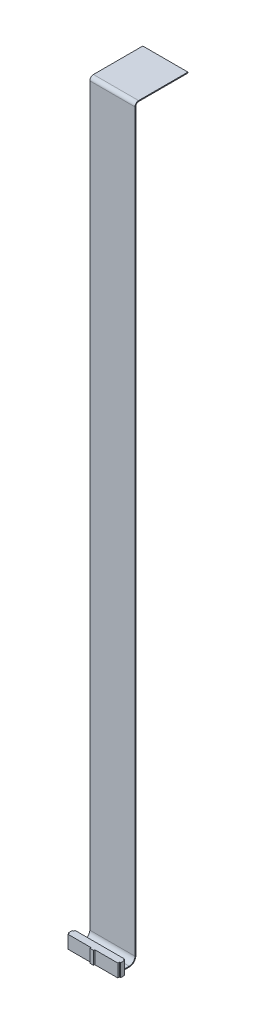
ISO-10303-21;
HEADER;
FILE_DESCRIPTION(('STEP AP214'),'2;1');
FILE_NAME('part.step','',(''),(''),'','','');
FILE_SCHEMA(('AUTOMOTIVE_DESIGN { 1 0 10303 214 1 1 1 1 }'));
ENDSEC;
DATA;
#1=APPLICATION_CONTEXT('core data for automotive mechanical design processes');
#2=APPLICATION_PROTOCOL_DEFINITION('international standard','automotive_design',2000,#1);
#3=PRODUCT_CONTEXT('',#1,'mechanical');
#4=PRODUCT('Part','Part','',(#3));
#5=PRODUCT_RELATED_PRODUCT_CATEGORY('part','',(#4));
#6=PRODUCT_DEFINITION_FORMATION('','',#4);
#7=PRODUCT_DEFINITION_CONTEXT('part definition',#1,'design');
#8=PRODUCT_DEFINITION('design','',#6,#7);
#9=PRODUCT_DEFINITION_SHAPE('','',#8);
#10=(LENGTH_UNIT() NAMED_UNIT(*) SI_UNIT(.MILLI.,.METRE.));
#11=(NAMED_UNIT(*) PLANE_ANGLE_UNIT() SI_UNIT($,.RADIAN.));
#12=(NAMED_UNIT(*) SI_UNIT($,.STERADIAN.) SOLID_ANGLE_UNIT());
#13=UNCERTAINTY_MEASURE_WITH_UNIT(LENGTH_MEASURE(1.E-05),#10,'distance_accuracy_value','');
#14=(GEOMETRIC_REPRESENTATION_CONTEXT(3) GLOBAL_UNCERTAINTY_ASSIGNED_CONTEXT((#13)) GLOBAL_UNIT_ASSIGNED_CONTEXT((#10,
#11,#12)) REPRESENTATION_CONTEXT('',''));
#15=CARTESIAN_POINT('',(0.,0.,0.));
#16=DIRECTION('',(0.,0.,1.));
#17=DIRECTION('',(1.,0.,0.));
#18=AXIS2_PLACEMENT_3D('',#15,#16,#17);
#19=CARTESIAN_POINT('',(-21.685,11.3,-6.));
#20=DIRECTION('',(1.,0.,0.));
#21=DIRECTION('',(0.,0.,-1.));
#22=AXIS2_PLACEMENT_3D('',#19,#20,#21);
#23=PLANE('',#22);
#24=DIRECTION('',(0.,0.,1.));
#25=VECTOR('',#24,1.);
#26=CARTESIAN_POINT('',(-21.685,0.,-6.));
#27=LINE('',#26,#25);
#28=CARTESIAN_POINT('',(-21.685,0.,-6.));
#29=VERTEX_POINT('',#28);
#30=CARTESIAN_POINT('',(-21.685,0.,-4.69999999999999));
#31=VERTEX_POINT('',#30);
#32=EDGE_CURVE('E329',#29,#31,#27,.T.);
#33=ORIENTED_EDGE('',*,*,#32,.T.);
#34=DIRECTION('',(0.,-1.,0.));
#35=VECTOR('',#34,1.);
#36=CARTESIAN_POINT('',(-21.685,11.3,-4.69999999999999));
#37=LINE('',#36,#35);
#38=CARTESIAN_POINT('',(-21.685,11.3,-4.69999999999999));
#39=VERTEX_POINT('',#38);
#40=EDGE_CURVE('E11',#39,#31,#37,.T.);
#41=ORIENTED_EDGE('',*,*,#40,.F.);
#42=DIRECTION('',(0.,0.,1.));
#43=VECTOR('',#42,1.);
#44=CARTESIAN_POINT('',(-21.685,11.3,-6.));
#45=LINE('',#44,#43);
#46=CARTESIAN_POINT('',(-21.685,11.3,-6.));
#47=VERTEX_POINT('',#46);
#48=EDGE_CURVE('E330',#47,#39,#45,.T.);
#49=ORIENTED_EDGE('',*,*,#48,.F.);
#50=DIRECTION('',(0.,-1.,0.));
#51=VECTOR('',#50,1.);
#52=CARTESIAN_POINT('',(-21.685,11.3,-6.));
#53=LINE('',#52,#51);
#54=EDGE_CURVE('E364',#47,#29,#53,.T.);
#55=ORIENTED_EDGE('',*,*,#54,.T.);
#56=EDGE_LOOP('',(#33,#41,#49,#55));
#57=FACE_BOUND('',#56,.T.);
#58=ADVANCED_FACE('F37',(#57),#23,.F.);
#59=CARTESIAN_POINT('',(-22.685,11.3,-4.69999999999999));
#60=DIRECTION('',(0.,0.,1.));
#61=DIRECTION('',(1.,0.,0.));
#62=AXIS2_PLACEMENT_3D('',#59,#60,#61);
#63=PLANE('',#62);
#64=DIRECTION('',(-1.,0.,0.));
#65=VECTOR('',#64,1.);
#66=CARTESIAN_POINT('',(-22.685,0.,-4.69999999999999));
#67=LINE('',#66,#65);
#68=CARTESIAN_POINT('',(-22.685,0.,-4.69999999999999));
#69=VERTEX_POINT('',#68);
#70=EDGE_CURVE('E367',#31,#69,#67,.T.);
#71=ORIENTED_EDGE('',*,*,#70,.T.);
#72=DIRECTION('',(0.,-1.,0.));
#73=VECTOR('',#72,1.);
#74=CARTESIAN_POINT('',(-22.685,11.3,-4.69999999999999));
#75=LINE('',#74,#73);
#76=CARTESIAN_POINT('',(-22.685,11.3,-4.69999999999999));
#77=VERTEX_POINT('',#76);
#78=EDGE_CURVE('E44',#77,#69,#75,.T.);
#79=ORIENTED_EDGE('',*,*,#78,.F.);
#80=DIRECTION('',(-1.,0.,0.));
#81=VECTOR('',#80,1.);
#82=CARTESIAN_POINT('',(-22.685,11.3,-4.69999999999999));
#83=LINE('',#82,#81);
#84=EDGE_CURVE('E333',#39,#77,#83,.T.);
#85=ORIENTED_EDGE('',*,*,#84,.F.);
#86=ORIENTED_EDGE('',*,*,#40,.T.);
#87=EDGE_LOOP('',(#71,#79,#85,#86));
#88=FACE_BOUND('',#87,.T.);
#89=ADVANCED_FACE('F464',(#88),#63,.F.);
#90=CARTESIAN_POINT('',(-22.685,11.3,-4.69999999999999));
#91=DIRECTION('',(1.,0.,0.));
#92=DIRECTION('',(0.,0.,-1.));
#93=AXIS2_PLACEMENT_3D('',#90,#91,#92);
#94=PLANE('',#93);
#95=DIRECTION('',(0.,0.,1.));
#96=VECTOR('',#95,1.);
#97=CARTESIAN_POINT('',(-22.685,0.,-4.69999999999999));
#98=LINE('',#97,#96);
#99=CARTESIAN_POINT('',(-22.685,0.,-1.3));
#100=VERTEX_POINT('',#99);
#101=EDGE_CURVE('E369',#69,#100,#98,.T.);
#102=ORIENTED_EDGE('',*,*,#101,.T.);
#103=DIRECTION('',(0.,-1.,0.));
#104=VECTOR('',#103,1.);
#105=CARTESIAN_POINT('',(-22.685,11.3,-1.3));
#106=LINE('',#105,#104);
#107=CARTESIAN_POINT('',(-22.685,11.3,-1.3));
#108=VERTEX_POINT('',#107);
#109=EDGE_CURVE('E434',#108,#100,#106,.T.);
#110=ORIENTED_EDGE('',*,*,#109,.F.);
#111=DIRECTION('',(0.,0.,1.));
#112=VECTOR('',#111,1.);
#113=CARTESIAN_POINT('',(-22.685,11.3,-4.69999999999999));
#114=LINE('',#113,#112);
#115=EDGE_CURVE('E336',#77,#108,#114,.T.);
#116=ORIENTED_EDGE('',*,*,#115,.F.);
#117=ORIENTED_EDGE('',*,*,#78,.T.);
#118=EDGE_LOOP('',(#102,#110,#116,#117));
#119=FACE_BOUND('',#118,.T.);
#120=ADVANCED_FACE('F441',(#119),#94,.F.);
#121=CARTESIAN_POINT('',(-22.685,11.3,-1.3));
#122=DIRECTION('',(0.,0.,-1.));
#123=DIRECTION('',(-1.,0.,0.));
#124=AXIS2_PLACEMENT_3D('',#121,#122,#123);
#125=PLANE('',#124);
#126=DIRECTION('',(1.,0.,0.));
#127=VECTOR('',#126,1.);
#128=CARTESIAN_POINT('',(-22.685,0.,-1.3));
#129=LINE('',#128,#127);
#130=CARTESIAN_POINT('',(-21.685,0.,-1.3));
#131=VERTEX_POINT('',#130);
#132=EDGE_CURVE('E371',#100,#131,#129,.T.);
#133=ORIENTED_EDGE('',*,*,#132,.T.);
#134=DIRECTION('',(0.,-1.,0.));
#135=VECTOR('',#134,1.);
#136=CARTESIAN_POINT('',(-21.685,11.3,-1.3));
#137=LINE('',#136,#135);
#138=CARTESIAN_POINT('',(-21.685,11.3,-1.3));
#139=VERTEX_POINT('',#138);
#140=EDGE_CURVE('E431',#139,#131,#137,.T.);
#141=ORIENTED_EDGE('',*,*,#140,.F.);
#142=DIRECTION('',(1.,0.,0.));
#143=VECTOR('',#142,1.);
#144=CARTESIAN_POINT('',(-22.685,11.3,-1.3));
#145=LINE('',#144,#143);
#146=EDGE_CURVE('E338',#108,#139,#145,.T.);
#147=ORIENTED_EDGE('',*,*,#146,.F.);
#148=ORIENTED_EDGE('',*,*,#109,.T.);
#149=EDGE_LOOP('',(#133,#141,#147,#148));
#150=FACE_BOUND('',#149,.T.);
#151=ADVANCED_FACE('F452',(#150),#125,.F.);
#152=CARTESIAN_POINT('',(-21.685,11.3,-1.3));
#153=DIRECTION('',(1.,0.,0.));
#154=DIRECTION('',(0.,0.,-1.));
#155=AXIS2_PLACEMENT_3D('',#152,#153,#154);
#156=PLANE('',#155);
#157=DIRECTION('',(0.,0.,1.));
#158=VECTOR('',#157,1.);
#159=CARTESIAN_POINT('',(-21.685,0.,-1.3));
#160=LINE('',#159,#158);
#161=CARTESIAN_POINT('',(-21.685,0.,0.));
#162=VERTEX_POINT('',#161);
#163=EDGE_CURVE('E373',#131,#162,#160,.T.);
#164=ORIENTED_EDGE('',*,*,#163,.T.);
#165=DIRECTION('',(0.,-1.,0.));
#166=VECTOR('',#165,1.);
#167=CARTESIAN_POINT('',(-21.685,11.3,0.));
#168=LINE('',#167,#166);
#169=CARTESIAN_POINT('',(-21.685,11.3,0.));
#170=VERTEX_POINT('',#169);
#171=EDGE_CURVE('E428',#170,#162,#168,.T.);
#172=ORIENTED_EDGE('',*,*,#171,.F.);
#173=DIRECTION('',(0.,0.,1.));
#174=VECTOR('',#173,1.);
#175=CARTESIAN_POINT('',(-21.685,11.3,-1.3));
#176=LINE('',#175,#174);
#177=EDGE_CURVE('E340',#139,#170,#176,.T.);
#178=ORIENTED_EDGE('',*,*,#177,.F.);
#179=ORIENTED_EDGE('',*,*,#140,.T.);
#180=EDGE_LOOP('',(#164,#172,#178,#179));
#181=FACE_BOUND('',#180,.T.);
#182=ADVANCED_FACE('F456',(#181),#156,.F.);
#183=CARTESIAN_POINT('',(-21.685,11.3,0.));
#184=DIRECTION('',(0.,0.,-1.));
#185=DIRECTION('',(-1.,0.,0.));
#186=AXIS2_PLACEMENT_3D('',#183,#184,#185);
#187=PLANE('',#186);
#188=DIRECTION('',(1.,0.,0.));
#189=VECTOR('',#188,1.);
#190=CARTESIAN_POINT('',(-21.685,0.,0.));
#191=LINE('',#190,#189);
#192=CARTESIAN_POINT('',(-1.6,0.,0.));
#193=VERTEX_POINT('',#192);
#194=EDGE_CURVE('E375',#162,#193,#191,.T.);
#195=ORIENTED_EDGE('',*,*,#194,.T.);
#196=DIRECTION('',(0.,-1.,0.));
#197=VECTOR('',#196,1.);
#198=CARTESIAN_POINT('',(-1.6,11.3,0.));
#199=LINE('',#198,#197);
#200=CARTESIAN_POINT('',(-1.6,11.3,0.));
#201=VERTEX_POINT('',#200);
#202=EDGE_CURVE('E425',#201,#193,#199,.T.);
#203=ORIENTED_EDGE('',*,*,#202,.F.);
#204=DIRECTION('',(1.,0.,0.));
#205=VECTOR('',#204,1.);
#206=CARTESIAN_POINT('',(-21.685,11.3,0.));
#207=LINE('',#206,#205);
#208=EDGE_CURVE('E342',#170,#201,#207,.T.);
#209=ORIENTED_EDGE('',*,*,#208,.F.);
#210=ORIENTED_EDGE('',*,*,#171,.T.);
#211=EDGE_LOOP('',(#195,#203,#209,#210));
#212=FACE_BOUND('',#211,.T.);
#213=ADVANCED_FACE('F517',(#212),#187,.F.);
#214=CARTESIAN_POINT('',(-1.6,11.3,0.));
#215=DIRECTION('',(1.,0.,0.));
#216=DIRECTION('',(0.,0.,-1.));
#217=AXIS2_PLACEMENT_3D('',#214,#215,#216);
#218=PLANE('',#217);
#219=DIRECTION('',(0.,0.,1.));
#220=VECTOR('',#219,1.);
#221=CARTESIAN_POINT('',(-1.6,0.,0.));
#222=LINE('',#221,#220);
#223=CARTESIAN_POINT('',(-1.6,0.,1.));
#224=VERTEX_POINT('',#223);
#225=EDGE_CURVE('E377',#193,#224,#222,.T.);
#226=ORIENTED_EDGE('',*,*,#225,.T.);
#227=DIRECTION('',(0.,-1.,0.));
#228=VECTOR('',#227,1.);
#229=CARTESIAN_POINT('',(-1.6,11.3,1.));
#230=LINE('',#229,#228);
#231=CARTESIAN_POINT('',(-1.6,11.3,1.));
#232=VERTEX_POINT('',#231);
#233=EDGE_CURVE('E422',#232,#224,#230,.T.);
#234=ORIENTED_EDGE('',*,*,#233,.F.);
#235=DIRECTION('',(0.,0.,1.));
#236=VECTOR('',#235,1.);
#237=CARTESIAN_POINT('',(-1.6,11.3,0.));
#238=LINE('',#237,#236);
#239=EDGE_CURVE('E344',#201,#232,#238,.T.);
#240=ORIENTED_EDGE('',*,*,#239,.F.);
#241=ORIENTED_EDGE('',*,*,#202,.T.);
#242=EDGE_LOOP('',(#226,#234,#240,#241));
#243=FACE_BOUND('',#242,.T.);
#244=ADVANCED_FACE('F514',(#243),#218,.F.);
#245=CARTESIAN_POINT('',(-1.6,11.3,1.));
#246=DIRECTION('',(0.,0.,-1.));
#247=DIRECTION('',(-1.,0.,0.));
#248=AXIS2_PLACEMENT_3D('',#245,#246,#247);
#249=PLANE('',#248);
#250=DIRECTION('',(1.,0.,0.));
#251=VECTOR('',#250,1.);
#252=CARTESIAN_POINT('',(-1.6,0.,1.));
#253=LINE('',#252,#251);
#254=CARTESIAN_POINT('',(1.6,0.,1.));
#255=VERTEX_POINT('',#254);
#256=EDGE_CURVE('E379',#224,#255,#253,.T.);
#257=ORIENTED_EDGE('',*,*,#256,.T.);
#258=DIRECTION('',(0.,-1.,0.));
#259=VECTOR('',#258,1.);
#260=CARTESIAN_POINT('',(1.6,11.3,1.));
#261=LINE('',#260,#259);
#262=CARTESIAN_POINT('',(1.6,11.3,1.));
#263=VERTEX_POINT('',#262);
#264=EDGE_CURVE('E419',#263,#255,#261,.T.);
#265=ORIENTED_EDGE('',*,*,#264,.F.);
#266=DIRECTION('',(1.,0.,0.));
#267=VECTOR('',#266,1.);
#268=CARTESIAN_POINT('',(-1.6,11.3,1.));
#269=LINE('',#268,#267);
#270=EDGE_CURVE('E346',#232,#263,#269,.T.);
#271=ORIENTED_EDGE('',*,*,#270,.F.);
#272=ORIENTED_EDGE('',*,*,#233,.T.);
#273=EDGE_LOOP('',(#257,#265,#271,#272));
#274=FACE_BOUND('',#273,.T.);
#275=ADVANCED_FACE('F510',(#274),#249,.F.);
#276=CARTESIAN_POINT('',(1.6,11.3,0.));
#277=DIRECTION('',(-1.,0.,0.));
#278=DIRECTION('',(0.,0.,1.));
#279=AXIS2_PLACEMENT_3D('',#276,#277,#278);
#280=PLANE('',#279);
#281=DIRECTION('',(0.,0.,-1.));
#282=VECTOR('',#281,1.);
#283=CARTESIAN_POINT('',(1.6,0.,0.));
#284=LINE('',#283,#282);
#285=CARTESIAN_POINT('',(1.6,0.,0.));
#286=VERTEX_POINT('',#285);
#287=EDGE_CURVE('E381',#255,#286,#284,.T.);
#288=ORIENTED_EDGE('',*,*,#287,.T.);
#289=DIRECTION('',(0.,-1.,0.));
#290=VECTOR('',#289,1.);
#291=CARTESIAN_POINT('',(1.6,11.3,0.));
#292=LINE('',#291,#290);
#293=CARTESIAN_POINT('',(1.6,11.3,0.));
#294=VERTEX_POINT('',#293);
#295=EDGE_CURVE('E416',#294,#286,#292,.T.);
#296=ORIENTED_EDGE('',*,*,#295,.F.);
#297=DIRECTION('',(0.,0.,-1.));
#298=VECTOR('',#297,1.);
#299=CARTESIAN_POINT('',(1.6,11.3,0.));
#300=LINE('',#299,#298);
#301=EDGE_CURVE('E348',#263,#294,#300,.T.);
#302=ORIENTED_EDGE('',*,*,#301,.F.);
#303=ORIENTED_EDGE('',*,*,#264,.T.);
#304=EDGE_LOOP('',(#288,#296,#302,#303));
#305=FACE_BOUND('',#304,.T.);
#306=ADVANCED_FACE('F506',(#305),#280,.F.);
#307=CARTESIAN_POINT('',(1.6,11.3,0.));
#308=DIRECTION('',(0.,0.,-1.));
#309=DIRECTION('',(-1.,0.,0.));
#310=AXIS2_PLACEMENT_3D('',#307,#308,#309);
#311=PLANE('',#310);
#312=DIRECTION('',(1.,0.,0.));
#313=VECTOR('',#312,1.);
#314=CARTESIAN_POINT('',(1.6,0.,0.));
#315=LINE('',#314,#313);
#316=CARTESIAN_POINT('',(21.685,0.,0.));
#317=VERTEX_POINT('',#316);
#318=EDGE_CURVE('E383',#286,#317,#315,.T.);
#319=ORIENTED_EDGE('',*,*,#318,.T.);
#320=DIRECTION('',(0.,-1.,0.));
#321=VECTOR('',#320,1.);
#322=CARTESIAN_POINT('',(21.685,11.3,0.));
#323=LINE('',#322,#321);
#324=CARTESIAN_POINT('',(21.685,11.3,0.));
#325=VERTEX_POINT('',#324);
#326=EDGE_CURVE('E413',#325,#317,#323,.T.);
#327=ORIENTED_EDGE('',*,*,#326,.F.);
#328=DIRECTION('',(1.,0.,0.));
#329=VECTOR('',#328,1.);
#330=CARTESIAN_POINT('',(1.6,11.3,0.));
#331=LINE('',#330,#329);
#332=EDGE_CURVE('E350',#294,#325,#331,.T.);
#333=ORIENTED_EDGE('',*,*,#332,.F.);
#334=ORIENTED_EDGE('',*,*,#295,.T.);
#335=EDGE_LOOP('',(#319,#327,#333,#334));
#336=FACE_BOUND('',#335,.T.);
#337=ADVANCED_FACE('F501',(#336),#311,.F.);
#338=CARTESIAN_POINT('',(21.685,11.3,-1.3));
#339=DIRECTION('',(-1.,0.,0.));
#340=DIRECTION('',(0.,0.,1.));
#341=AXIS2_PLACEMENT_3D('',#338,#339,#340);
#342=PLANE('',#341);
#343=DIRECTION('',(0.,0.,-1.));
#344=VECTOR('',#343,1.);
#345=CARTESIAN_POINT('',(21.685,0.,-1.3));
#346=LINE('',#345,#344);
#347=CARTESIAN_POINT('',(21.685,0.,-1.3));
#348=VERTEX_POINT('',#347);
#349=EDGE_CURVE('E385',#317,#348,#346,.T.);
#350=ORIENTED_EDGE('',*,*,#349,.T.);
#351=DIRECTION('',(0.,-1.,0.));
#352=VECTOR('',#351,1.);
#353=CARTESIAN_POINT('',(21.685,11.3,-1.3));
#354=LINE('',#353,#352);
#355=CARTESIAN_POINT('',(21.685,11.3,-1.3));
#356=VERTEX_POINT('',#355);
#357=EDGE_CURVE('E410',#356,#348,#354,.T.);
#358=ORIENTED_EDGE('',*,*,#357,.F.);
#359=DIRECTION('',(0.,0.,-1.));
#360=VECTOR('',#359,1.);
#361=CARTESIAN_POINT('',(21.685,11.3,-1.3));
#362=LINE('',#361,#360);
#363=EDGE_CURVE('E352',#325,#356,#362,.T.);
#364=ORIENTED_EDGE('',*,*,#363,.F.);
#365=ORIENTED_EDGE('',*,*,#326,.T.);
#366=EDGE_LOOP('',(#350,#358,#364,#365));
#367=FACE_BOUND('',#366,.T.);
#368=ADVANCED_FACE('F495',(#367),#342,.F.);
#369=CARTESIAN_POINT('',(21.685,11.3,-1.3));
#370=DIRECTION('',(0.,0.,-1.));
#371=DIRECTION('',(-1.,0.,0.));
#372=AXIS2_PLACEMENT_3D('',#369,#370,#371);
#373=PLANE('',#372);
#374=DIRECTION('',(1.,0.,0.));
#375=VECTOR('',#374,1.);
#376=CARTESIAN_POINT('',(21.685,0.,-1.3));
#377=LINE('',#376,#375);
#378=CARTESIAN_POINT('',(22.685,0.,-1.30000000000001));
#379=VERTEX_POINT('',#378);
#380=EDGE_CURVE('E387',#348,#379,#377,.T.);
#381=ORIENTED_EDGE('',*,*,#380,.T.);
#382=DIRECTION('',(0.,-1.,0.));
#383=VECTOR('',#382,1.);
#384=CARTESIAN_POINT('',(22.685,11.3,-1.30000000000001));
#385=LINE('',#384,#383);
#386=CARTESIAN_POINT('',(22.685,11.3,-1.30000000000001));
#387=VERTEX_POINT('',#386);
#388=EDGE_CURVE('E407',#387,#379,#385,.T.);
#389=ORIENTED_EDGE('',*,*,#388,.F.);
#390=DIRECTION('',(1.,0.,0.));
#391=VECTOR('',#390,1.);
#392=CARTESIAN_POINT('',(21.685,11.3,-1.3));
#393=LINE('',#392,#391);
#394=EDGE_CURVE('E354',#356,#387,#393,.T.);
#395=ORIENTED_EDGE('',*,*,#394,.F.);
#396=ORIENTED_EDGE('',*,*,#357,.T.);
#397=EDGE_LOOP('',(#381,#389,#395,#396));
#398=FACE_BOUND('',#397,.T.);
#399=ADVANCED_FACE('F491',(#398),#373,.F.);
#400=CARTESIAN_POINT('',(22.685,11.3,-4.69999999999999));
#401=DIRECTION('',(-1.,0.,0.));
#402=DIRECTION('',(0.,0.,1.));
#403=AXIS2_PLACEMENT_3D('',#400,#401,#402);
#404=PLANE('',#403);
#405=DIRECTION('',(0.,0.,-1.));
#406=VECTOR('',#405,1.);
#407=CARTESIAN_POINT('',(22.685,0.,-4.69999999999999));
#408=LINE('',#407,#406);
#409=CARTESIAN_POINT('',(22.685,0.,-4.69999999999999));
#410=VERTEX_POINT('',#409);
#411=EDGE_CURVE('E389',#379,#410,#408,.T.);
#412=ORIENTED_EDGE('',*,*,#411,.T.);
#413=DIRECTION('',(0.,-1.,0.));
#414=VECTOR('',#413,1.);
#415=CARTESIAN_POINT('',(22.685,11.3,-4.69999999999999));
#416=LINE('',#415,#414);
#417=CARTESIAN_POINT('',(22.685,11.3,-4.69999999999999));
#418=VERTEX_POINT('',#417);
#419=EDGE_CURVE('E404',#418,#410,#416,.T.);
#420=ORIENTED_EDGE('',*,*,#419,.F.);
#421=DIRECTION('',(0.,0.,-1.));
#422=VECTOR('',#421,1.);
#423=CARTESIAN_POINT('',(22.685,11.3,-4.69999999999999));
#424=LINE('',#423,#422);
#425=EDGE_CURVE('E356',#387,#418,#424,.T.);
#426=ORIENTED_EDGE('',*,*,#425,.F.);
#427=ORIENTED_EDGE('',*,*,#388,.T.);
#428=EDGE_LOOP('',(#412,#420,#426,#427));
#429=FACE_BOUND('',#428,.T.);
#430=ADVANCED_FACE('F486',(#429),#404,.F.);
#431=CARTESIAN_POINT('',(21.685,11.3,-4.7));
#432=DIRECTION('',(0.,0.,1.));
#433=DIRECTION('',(1.,0.,0.));
#434=AXIS2_PLACEMENT_3D('',#431,#432,#433);
#435=PLANE('',#434);
#436=DIRECTION('',(-1.,0.,0.));
#437=VECTOR('',#436,1.);
#438=CARTESIAN_POINT('',(21.685,0.,-4.7));
#439=LINE('',#438,#437);
#440=CARTESIAN_POINT('',(21.685,0.,-4.7));
#441=VERTEX_POINT('',#440);
#442=EDGE_CURVE('E391',#410,#441,#439,.T.);
#443=ORIENTED_EDGE('',*,*,#442,.T.);
#444=DIRECTION('',(0.,-1.,0.));
#445=VECTOR('',#444,1.);
#446=CARTESIAN_POINT('',(21.685,11.3,-4.7));
#447=LINE('',#446,#445);
#448=CARTESIAN_POINT('',(21.685,11.3,-4.7));
#449=VERTEX_POINT('',#448);
#450=EDGE_CURVE('E401',#449,#441,#447,.T.);
#451=ORIENTED_EDGE('',*,*,#450,.F.);
#452=DIRECTION('',(-1.,0.,0.));
#453=VECTOR('',#452,1.);
#454=CARTESIAN_POINT('',(21.685,11.3,-4.7));
#455=LINE('',#454,#453);
#456=EDGE_CURVE('E358',#418,#449,#455,.T.);
#457=ORIENTED_EDGE('',*,*,#456,.F.);
#458=ORIENTED_EDGE('',*,*,#419,.T.);
#459=EDGE_LOOP('',(#443,#451,#457,#458));
#460=FACE_BOUND('',#459,.T.);
#461=ADVANCED_FACE('F480',(#460),#435,.F.);
#462=CARTESIAN_POINT('',(21.685,11.3,-6.00000000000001));
#463=DIRECTION('',(-1.,0.,0.));
#464=DIRECTION('',(0.,0.,1.));
#465=AXIS2_PLACEMENT_3D('',#462,#463,#464);
#466=PLANE('',#465);
#467=DIRECTION('',(0.,0.,-1.));
#468=VECTOR('',#467,1.);
#469=CARTESIAN_POINT('',(21.685,0.,-6.00000000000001));
#470=LINE('',#469,#468);
#471=CARTESIAN_POINT('',(21.685,0.,-6.00000000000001));
#472=VERTEX_POINT('',#471);
#473=EDGE_CURVE('E393',#441,#472,#470,.T.);
#474=ORIENTED_EDGE('',*,*,#473,.T.);
#475=DIRECTION('',(0.,-1.,0.));
#476=VECTOR('',#475,1.);
#477=CARTESIAN_POINT('',(21.685,11.3,-6.00000000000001));
#478=LINE('',#477,#476);
#479=CARTESIAN_POINT('',(21.685,11.3,-6.00000000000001));
#480=VERTEX_POINT('',#479);
#481=EDGE_CURVE('E398',#480,#472,#478,.T.);
#482=ORIENTED_EDGE('',*,*,#481,.F.);
#483=DIRECTION('',(0.,0.,-1.));
#484=VECTOR('',#483,1.);
#485=CARTESIAN_POINT('',(21.685,11.3,-6.00000000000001));
#486=LINE('',#485,#484);
#487=EDGE_CURVE('E360',#449,#480,#486,.T.);
#488=ORIENTED_EDGE('',*,*,#487,.F.);
#489=ORIENTED_EDGE('',*,*,#450,.T.);
#490=EDGE_LOOP('',(#474,#482,#488,#489));
#491=FACE_BOUND('',#490,.T.);
#492=ADVANCED_FACE('F476',(#491),#466,.F.);
#493=CARTESIAN_POINT('',(-21.685,11.3,-6.));
#494=DIRECTION('',(0.,0.,1.));
#495=DIRECTION('',(1.,0.,0.));
#496=AXIS2_PLACEMENT_3D('',#493,#494,#495);
#497=PLANE('',#496);
#498=DIRECTION('',(-1.,0.,0.));
#499=VECTOR('',#498,1.);
#500=CARTESIAN_POINT('',(19.685,1.2,-6.00000000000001));
#501=LINE('',#500,#499);
#502=CARTESIAN_POINT('',(19.685,1.2,-6.00000000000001));
#503=VERTEX_POINT('',#502);
#504=CARTESIAN_POINT('',(-19.685,1.2,-6.));
#505=VERTEX_POINT('',#504);
#506=EDGE_CURVE('E51',#503,#505,#501,.T.);
#507=ORIENTED_EDGE('',*,*,#506,.F.);
#508=DIRECTION('',(0.,-1.,0.));
#509=VECTOR('',#508,1.);
#510=CARTESIAN_POINT('',(19.685,2.,-6.00000000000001));
#511=LINE('',#510,#509);
#512=CARTESIAN_POINT('',(19.685,2.,-6.00000000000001));
#513=VERTEX_POINT('',#512);
#514=EDGE_CURVE('E56',#513,#503,#511,.T.);
#515=ORIENTED_EDGE('',*,*,#514,.F.);
#516=DIRECTION('',(-1.,0.,0.));
#517=VECTOR('',#516,1.);
#518=CARTESIAN_POINT('',(19.685,2.,-6.00000000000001));
#519=LINE('',#518,#517);
#520=CARTESIAN_POINT('',(-19.685,2.,-6.00000000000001));
#521=VERTEX_POINT('',#520);
#522=EDGE_CURVE('E323',#513,#521,#519,.T.);
#523=ORIENTED_EDGE('',*,*,#522,.T.);
#524=DIRECTION('',(0.,-1.,0.));
#525=VECTOR('',#524,1.);
#526=CARTESIAN_POINT('',(-19.685,2.,-6.00000000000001));
#527=LINE('',#526,#525);
#528=EDGE_CURVE('E228',#521,#505,#527,.T.);
#529=ORIENTED_EDGE('',*,*,#528,.T.);
#530=EDGE_LOOP('',(#507,#515,#523,#529));
#531=FACE_BOUND('',#530,.T.);
#532=DIRECTION('',(-1.,0.,0.));
#533=VECTOR('',#532,1.);
#534=CARTESIAN_POINT('',(-21.685,0.,-6.));
#535=LINE('',#534,#533);
#536=EDGE_CURVE('E334',#472,#29,#535,.T.);
#537=ORIENTED_EDGE('',*,*,#536,.T.);
#538=ORIENTED_EDGE('',*,*,#54,.F.);
#539=DIRECTION('',(-1.,0.,0.));
#540=VECTOR('',#539,1.);
#541=CARTESIAN_POINT('',(-21.685,11.3,-6.));
#542=LINE('',#541,#540);
#543=EDGE_CURVE('E362',#480,#47,#542,.T.);
#544=ORIENTED_EDGE('',*,*,#543,.F.);
#545=ORIENTED_EDGE('',*,*,#481,.T.);
#546=EDGE_LOOP('',(#537,#538,#544,#545));
#547=FACE_BOUND('',#546,.T.);
#548=ADVANCED_FACE('F471',(#531,#547),#497,.F.);
#549=CARTESIAN_POINT('',(-21.685,11.3,-4.69999999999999));
#550=DIRECTION('',(0.,1.,0.));
#551=DIRECTION('',(0.,0.,1.));
#552=AXIS2_PLACEMENT_3D('',#549,#550,#551);
#553=PLANE('',#552);
#554=ORIENTED_EDGE('',*,*,#48,.T.);
#555=ORIENTED_EDGE('',*,*,#84,.T.);
#556=ORIENTED_EDGE('',*,*,#115,.T.);
#557=ORIENTED_EDGE('',*,*,#146,.T.);
#558=ORIENTED_EDGE('',*,*,#177,.T.);
#559=ORIENTED_EDGE('',*,*,#208,.T.);
#560=ORIENTED_EDGE('',*,*,#239,.T.);
#561=ORIENTED_EDGE('',*,*,#270,.T.);
#562=ORIENTED_EDGE('',*,*,#301,.T.);
#563=ORIENTED_EDGE('',*,*,#332,.T.);
#564=ORIENTED_EDGE('',*,*,#363,.T.);
#565=ORIENTED_EDGE('',*,*,#394,.T.);
#566=ORIENTED_EDGE('',*,*,#425,.T.);
#567=ORIENTED_EDGE('',*,*,#456,.T.);
#568=ORIENTED_EDGE('',*,*,#487,.T.);
#569=ORIENTED_EDGE('',*,*,#543,.T.);
#570=EDGE_LOOP('',(#554,#555,#556,#557,#558,#559,#560,#561,#562,#563,#564,#565,#566,#567,#568,#569));
#571=FACE_BOUND('',#570,.T.);
#572=ADVANCED_FACE('F460',(#571),#553,.T.);
#573=CARTESIAN_POINT('',(-21.685,0.,-4.69999999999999));
#574=DIRECTION('',(0.,1.,0.));
#575=DIRECTION('',(0.,0.,1.));
#576=AXIS2_PLACEMENT_3D('',#573,#574,#575);
#577=PLANE('',#576);
#578=ORIENTED_EDGE('',*,*,#32,.F.);
#579=ORIENTED_EDGE('',*,*,#536,.F.);
#580=ORIENTED_EDGE('',*,*,#473,.F.);
#581=ORIENTED_EDGE('',*,*,#442,.F.);
#582=ORIENTED_EDGE('',*,*,#411,.F.);
#583=ORIENTED_EDGE('',*,*,#380,.F.);
#584=ORIENTED_EDGE('',*,*,#349,.F.);
#585=ORIENTED_EDGE('',*,*,#318,.F.);
#586=ORIENTED_EDGE('',*,*,#287,.F.);
#587=ORIENTED_EDGE('',*,*,#256,.F.);
#588=ORIENTED_EDGE('',*,*,#225,.F.);
#589=ORIENTED_EDGE('',*,*,#194,.F.);
#590=ORIENTED_EDGE('',*,*,#163,.F.);
#591=ORIENTED_EDGE('',*,*,#132,.F.);
#592=ORIENTED_EDGE('',*,*,#101,.F.);
#593=ORIENTED_EDGE('',*,*,#70,.F.);
#594=EDGE_LOOP('',(#578,#579,#580,#581,#582,#583,#584,#585,#586,#587,#588,#589,#590,#591,#592,#593));
#595=FACE_BOUND('',#594,.T.);
#596=ADVANCED_FACE('F447',(#595),#577,.F.);
#597=CARTESIAN_POINT('',(19.685,1.2,-6.00000000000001));
#598=DIRECTION('',(0.,1.,0.));
#599=DIRECTION('',(0.,0.,1.));
#600=AXIS2_PLACEMENT_3D('',#597,#598,#599);
#601=PLANE('',#600);
#602=DIRECTION('',(0.,0.,-1.));
#603=VECTOR('',#602,1.);
#604=CARTESIAN_POINT('',(-19.685,1.2,-6.00000000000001));
#605=LINE('',#604,#603);
#606=CARTESIAN_POINT('',(-19.685,1.2,-11.9375));
#607=VERTEX_POINT('',#606);
#608=EDGE_CURVE('E220',#505,#607,#605,.T.);
#609=ORIENTED_EDGE('',*,*,#608,.T.);
#610=DIRECTION('',(-1.,0.,0.));
#611=VECTOR('',#610,1.);
#612=CARTESIAN_POINT('',(19.685,1.2,-11.9375));
#613=LINE('',#612,#611);
#614=CARTESIAN_POINT('',(19.685,1.2,-11.9375));
#615=VERTEX_POINT('',#614);
#616=EDGE_CURVE('E224',#615,#607,#613,.T.);
#617=ORIENTED_EDGE('',*,*,#616,.F.);
#618=DIRECTION('',(0.,0.,-1.));
#619=VECTOR('',#618,1.);
#620=CARTESIAN_POINT('',(19.685,1.2,-6.00000000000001));
#621=LINE('',#620,#619);
#622=EDGE_CURVE('E319',#503,#615,#621,.T.);
#623=ORIENTED_EDGE('',*,*,#622,.F.);
#624=ORIENTED_EDGE('',*,*,#506,.T.);
#625=EDGE_LOOP('',(#609,#617,#623,#624));
#626=FACE_BOUND('',#625,.T.);
#627=ADVANCED_FACE('F222',(#626),#601,.F.);
#628=CARTESIAN_POINT('',(19.685,2.,-6.00000000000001));
#629=DIRECTION('',(0.,-1.,0.));
#630=DIRECTION('',(0.,0.,-1.));
#631=AXIS2_PLACEMENT_3D('',#628,#629,#630);
#632=PLANE('',#631);
#633=DIRECTION('',(0.,0.,1.));
#634=VECTOR('',#633,1.);
#635=CARTESIAN_POINT('',(-19.685,2.,-6.00000000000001));
#636=LINE('',#635,#634);
#637=CARTESIAN_POINT('',(-19.685,2.,-11.9375));
#638=VERTEX_POINT('',#637);
#639=EDGE_CURVE('E227',#638,#521,#636,.T.);
#640=ORIENTED_EDGE('',*,*,#639,.T.);
#641=ORIENTED_EDGE('',*,*,#522,.F.);
#642=DIRECTION('',(0.,0.,1.));
#643=VECTOR('',#642,1.);
#644=CARTESIAN_POINT('',(19.685,2.,-6.00000000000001));
#645=LINE('',#644,#643);
#646=CARTESIAN_POINT('',(19.685,2.,-11.9375));
#647=VERTEX_POINT('',#646);
#648=EDGE_CURVE('E321',#647,#513,#645,.T.);
#649=ORIENTED_EDGE('',*,*,#648,.F.);
#650=DIRECTION('',(1.,0.,0.));
#651=VECTOR('',#650,1.);
#652=CARTESIAN_POINT('',(-19.685,2.,-11.9375));
#653=LINE('',#652,#651);
#654=EDGE_CURVE('E245',#638,#647,#653,.T.);
#655=ORIENTED_EDGE('',*,*,#654,.F.);
#656=EDGE_LOOP('',(#640,#641,#649,#655));
#657=FACE_BOUND('',#656,.T.);
#658=ADVANCED_FACE('F652',(#657),#632,.F.);
#659=CARTESIAN_POINT('',(19.685,1.2,-6.00000000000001));
#660=DIRECTION('',(1.,0.,0.));
#661=DIRECTION('',(0.,0.,-1.));
#662=AXIS2_PLACEMENT_3D('',#659,#660,#661);
#663=PLANE('',#662);
#664=ORIENTED_EDGE('',*,*,#514,.T.);
#665=ORIENTED_EDGE('',*,*,#622,.T.);
#666=CARTESIAN_POINT('',(19.685,6.99999999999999,-11.9375));
#667=DIRECTION('',(1.,0.,0.));
#668=DIRECTION('',(0.,0.,-1.));
#669=AXIS2_PLACEMENT_3D('',#666,#667,#668);
#670=CIRCLE('',#669,5.79999999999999);
#671=CARTESIAN_POINT('',(19.685,7.,-17.7375));
#672=VERTEX_POINT('',#671);
#673=EDGE_CURVE('E244',#615,#672,#670,.T.);
#674=ORIENTED_EDGE('',*,*,#673,.T.);
#675=DIRECTION('',(0.,1.,0.));
#676=VECTOR('',#675,1.);
#677=CARTESIAN_POINT('',(19.685,7.,-17.7375));
#678=LINE('',#677,#676);
#679=CARTESIAN_POINT('',(19.685,648.346239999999,-17.7375));
#680=VERTEX_POINT('',#679);
#681=EDGE_CURVE('E266',#672,#680,#678,.T.);
#682=ORIENTED_EDGE('',*,*,#681,.T.);
#683=CARTESIAN_POINT('',(19.685,648.346239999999,-20.1125));
#684=DIRECTION('',(-1.,0.,0.));
#685=DIRECTION('',(0.,0.,1.));
#686=AXIS2_PLACEMENT_3D('',#683,#684,#685);
#687=CIRCLE('',#686,2.37500000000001);
#688=CARTESIAN_POINT('',(19.685,650.721239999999,-20.1125));
#689=VERTEX_POINT('',#688);
#690=EDGE_CURVE('E282',#680,#689,#687,.T.);
#691=ORIENTED_EDGE('',*,*,#690,.T.);
#692=DIRECTION('',(0.,0.,-1.));
#693=VECTOR('',#692,1.);
#694=CARTESIAN_POINT('',(19.685,650.721239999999,-20.1125));
#695=LINE('',#694,#693);
#696=CARTESIAN_POINT('',(19.685,650.721239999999,-63.1287999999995));
#697=VERTEX_POINT('',#696);
#698=EDGE_CURVE('E306',#689,#697,#695,.T.);
#699=ORIENTED_EDGE('',*,*,#698,.T.);
#700=DIRECTION('',(0.,-1.,0.));
#701=VECTOR('',#700,1.);
#702=CARTESIAN_POINT('',(19.685,651.521239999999,-63.1287999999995));
#703=LINE('',#702,#701);
#704=CARTESIAN_POINT('',(19.685,651.521239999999,-63.1287999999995));
#705=VERTEX_POINT('',#704);
#706=EDGE_CURVE('E297',#705,#697,#703,.T.);
#707=ORIENTED_EDGE('',*,*,#706,.F.);
#708=DIRECTION('',(0.,0.,-1.));
#709=VECTOR('',#708,1.);
#710=CARTESIAN_POINT('',(19.685,651.521239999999,-20.1125));
#711=LINE('',#710,#709);
#712=CARTESIAN_POINT('',(19.685,651.521239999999,-20.1125));
#713=VERTEX_POINT('',#712);
#714=EDGE_CURVE('E309',#713,#705,#711,.T.);
#715=ORIENTED_EDGE('',*,*,#714,.F.);
#716=CARTESIAN_POINT('',(19.685,648.346239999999,-20.1125));
#717=DIRECTION('',(-1.,0.,0.));
#718=DIRECTION('',(0.,0.,1.));
#719=AXIS2_PLACEMENT_3D('',#716,#717,#718);
#720=CIRCLE('',#719,3.175);
#721=CARTESIAN_POINT('',(19.685,648.346239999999,-16.9375));
#722=VERTEX_POINT('',#721);
#723=EDGE_CURVE('E285',#722,#713,#720,.T.);
#724=ORIENTED_EDGE('',*,*,#723,.F.);
#725=DIRECTION('',(0.,1.,0.));
#726=VECTOR('',#725,1.);
#727=CARTESIAN_POINT('',(19.685,7.,-16.9375));
#728=LINE('',#727,#726);
#729=CARTESIAN_POINT('',(19.685,7.,-16.9375));
#730=VERTEX_POINT('',#729);
#731=EDGE_CURVE('E269',#730,#722,#728,.T.);
#732=ORIENTED_EDGE('',*,*,#731,.F.);
#733=CARTESIAN_POINT('',(19.685,6.99999999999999,-11.9375));
#734=DIRECTION('',(1.,0.,0.));
#735=DIRECTION('',(0.,0.,-1.));
#736=AXIS2_PLACEMENT_3D('',#733,#734,#735);
#737=CIRCLE('',#736,4.99999999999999);
#738=EDGE_CURVE('E256',#647,#730,#737,.T.);
#739=ORIENTED_EDGE('',*,*,#738,.F.);
#740=ORIENTED_EDGE('',*,*,#648,.T.);
#741=EDGE_LOOP('',(#664,#665,#674,#682,#691,#699,#707,#715,#724,#732,#739,#740));
#742=FACE_BOUND('',#741,.T.);
#743=ADVANCED_FACE('F662',(#742),#663,.T.);
#744=CARTESIAN_POINT('',(-19.685,1.2,-6.00000000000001));
#745=DIRECTION('',(1.,0.,0.));
#746=DIRECTION('',(0.,0.,-1.));
#747=AXIS2_PLACEMENT_3D('',#744,#745,#746);
#748=PLANE('',#747);
#749=ORIENTED_EDGE('',*,*,#528,.F.);
#750=ORIENTED_EDGE('',*,*,#639,.F.);
#751=CARTESIAN_POINT('',(-19.685,6.99999999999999,-11.9375));
#752=DIRECTION('',(1.,0.,0.));
#753=DIRECTION('',(0.,0.,-1.));
#754=AXIS2_PLACEMENT_3D('',#751,#752,#753);
#755=CIRCLE('',#754,4.99999999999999);
#756=CARTESIAN_POINT('',(-19.685,6.99999999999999,-16.9375));
#757=VERTEX_POINT('',#756);
#758=EDGE_CURVE('E239',#638,#757,#755,.T.);
#759=ORIENTED_EDGE('',*,*,#758,.T.);
#760=DIRECTION('',(0.,1.,0.));
#761=VECTOR('',#760,1.);
#762=CARTESIAN_POINT('',(-19.685,6.99999999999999,-16.9375));
#763=LINE('',#762,#761);
#764=CARTESIAN_POINT('',(-19.685,648.346239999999,-16.9375));
#765=VERTEX_POINT('',#764);
#766=EDGE_CURVE('E272',#757,#765,#763,.T.);
#767=ORIENTED_EDGE('',*,*,#766,.T.);
#768=CARTESIAN_POINT('',(-19.685,648.346239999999,-20.1125));
#769=DIRECTION('',(-1.,0.,0.));
#770=DIRECTION('',(0.,0.,1.));
#771=AXIS2_PLACEMENT_3D('',#768,#769,#770);
#772=CIRCLE('',#771,3.175);
#773=CARTESIAN_POINT('',(-19.685,651.521239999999,-20.1125));
#774=VERTEX_POINT('',#773);
#775=EDGE_CURVE('E288',#765,#774,#772,.T.);
#776=ORIENTED_EDGE('',*,*,#775,.T.);
#777=DIRECTION('',(0.,0.,-1.));
#778=VECTOR('',#777,1.);
#779=CARTESIAN_POINT('',(-19.685,651.521239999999,-20.1125));
#780=LINE('',#779,#778);
#781=CARTESIAN_POINT('',(-19.685,651.521239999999,-63.1287999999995));
#782=VERTEX_POINT('',#781);
#783=EDGE_CURVE('E312',#774,#782,#780,.T.);
#784=ORIENTED_EDGE('',*,*,#783,.T.);
#785=DIRECTION('',(0.,1.,0.));
#786=VECTOR('',#785,1.);
#787=CARTESIAN_POINT('',(-19.685,650.721239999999,-63.1287999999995));
#788=LINE('',#787,#786);
#789=CARTESIAN_POINT('',(-19.685,650.721239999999,-63.1287999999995));
#790=VERTEX_POINT('',#789);
#791=EDGE_CURVE('E303',#790,#782,#788,.T.);
#792=ORIENTED_EDGE('',*,*,#791,.F.);
#793=DIRECTION('',(0.,0.,-1.));
#794=VECTOR('',#793,1.);
#795=CARTESIAN_POINT('',(-19.685,650.721239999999,-20.1125));
#796=LINE('',#795,#794);
#797=CARTESIAN_POINT('',(-19.685,650.721239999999,-20.1125));
#798=VERTEX_POINT('',#797);
#799=EDGE_CURVE('E315',#798,#790,#796,.T.);
#800=ORIENTED_EDGE('',*,*,#799,.F.);
#801=CARTESIAN_POINT('',(-19.685,648.346239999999,-20.1125));
#802=DIRECTION('',(-1.,0.,0.));
#803=DIRECTION('',(0.,0.,1.));
#804=AXIS2_PLACEMENT_3D('',#801,#802,#803);
#805=CIRCLE('',#804,2.37500000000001);
#806=CARTESIAN_POINT('',(-19.685,648.346239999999,-17.7375));
#807=VERTEX_POINT('',#806);
#808=EDGE_CURVE('E291',#807,#798,#805,.T.);
#809=ORIENTED_EDGE('',*,*,#808,.F.);
#810=DIRECTION('',(0.,1.,0.));
#811=VECTOR('',#810,1.);
#812=CARTESIAN_POINT('',(-19.685,6.99999999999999,-17.7375));
#813=LINE('',#812,#811);
#814=CARTESIAN_POINT('',(-19.685,6.99999999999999,-17.7375));
#815=VERTEX_POINT('',#814);
#816=EDGE_CURVE('E234',#815,#807,#813,.T.);
#817=ORIENTED_EDGE('',*,*,#816,.F.);
#818=CARTESIAN_POINT('',(-19.685,6.99999999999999,-11.9375));
#819=DIRECTION('',(1.,0.,0.));
#820=DIRECTION('',(0.,0.,-1.));
#821=AXIS2_PLACEMENT_3D('',#818,#819,#820);
#822=CIRCLE('',#821,5.79999999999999);
#823=EDGE_CURVE('E231',#607,#815,#822,.T.);
#824=ORIENTED_EDGE('',*,*,#823,.F.);
#825=ORIENTED_EDGE('',*,*,#608,.F.);
#826=EDGE_LOOP('',(#749,#750,#759,#767,#776,#784,#792,#800,#809,#817,#824,#825));
#827=FACE_BOUND('',#826,.T.);
#828=ADVANCED_FACE('F232',(#827),#748,.F.);
#829=CARTESIAN_POINT('',(-19.685,651.521239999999,-20.1125));
#830=DIRECTION('',(0.,1.,0.));
#831=DIRECTION('',(-1.,0.,0.));
#832=AXIS2_PLACEMENT_3D('',#829,#830,#831);
#833=PLANE('',#832);
#834=DIRECTION('',(1.,0.,0.));
#835=VECTOR('',#834,1.);
#836=CARTESIAN_POINT('',(-19.685,651.521239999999,-20.1125));
#837=LINE('',#836,#835);
#838=EDGE_CURVE('E279',#774,#713,#837,.T.);
#839=ORIENTED_EDGE('',*,*,#838,.T.);
#840=ORIENTED_EDGE('',*,*,#714,.T.);
#841=DIRECTION('',(1.,0.,0.));
#842=VECTOR('',#841,1.);
#843=CARTESIAN_POINT('',(-19.685,651.521239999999,-63.1287999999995));
#844=LINE('',#843,#842);
#845=EDGE_CURVE('E300',#782,#705,#844,.T.);
#846=ORIENTED_EDGE('',*,*,#845,.F.);
#847=ORIENTED_EDGE('',*,*,#783,.F.);
#848=EDGE_LOOP('',(#839,#840,#846,#847));
#849=FACE_BOUND('',#848,.T.);
#850=ADVANCED_FACE('F685',(#849),#833,.T.);
#851=CARTESIAN_POINT('',(19.685,650.721239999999,-20.1125));
#852=DIRECTION('',(0.,-1.,0.));
#853=DIRECTION('',(1.,0.,0.));
#854=AXIS2_PLACEMENT_3D('',#851,#852,#853);
#855=PLANE('',#854);
#856=DIRECTION('',(-1.,0.,0.));
#857=VECTOR('',#856,1.);
#858=CARTESIAN_POINT('',(19.685,650.721239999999,-20.1125));
#859=LINE('',#858,#857);
#860=EDGE_CURVE('E276',#689,#798,#859,.T.);
#861=ORIENTED_EDGE('',*,*,#860,.T.);
#862=ORIENTED_EDGE('',*,*,#799,.T.);
#863=DIRECTION('',(-1.,0.,0.));
#864=VECTOR('',#863,1.);
#865=CARTESIAN_POINT('',(19.685,650.721239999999,-63.1287999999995));
#866=LINE('',#865,#864);
#867=EDGE_CURVE('E294',#697,#790,#866,.T.);
#868=ORIENTED_EDGE('',*,*,#867,.F.);
#869=ORIENTED_EDGE('',*,*,#698,.F.);
#870=EDGE_LOOP('',(#861,#862,#868,#869));
#871=FACE_BOUND('',#870,.T.);
#872=ADVANCED_FACE('F695',(#871),#855,.T.);
#873=CARTESIAN_POINT('',(0.,648.346239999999,-20.1125));
#874=DIRECTION('',(-1.,0.,0.));
#875=DIRECTION('',(0.,0.,1.));
#876=AXIS2_PLACEMENT_3D('',#873,#874,#875);
#877=CYLINDRICAL_SURFACE('',#876,3.175);
#878=DIRECTION('',(1.,0.,0.));
#879=VECTOR('',#878,1.);
#880=CARTESIAN_POINT('',(-19.685,648.346239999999,-16.9375));
#881=LINE('',#880,#879);
#882=EDGE_CURVE('E263',#765,#722,#881,.T.);
#883=ORIENTED_EDGE('',*,*,#882,.T.);
#884=ORIENTED_EDGE('',*,*,#723,.T.);
#885=ORIENTED_EDGE('',*,*,#838,.F.);
#886=ORIENTED_EDGE('',*,*,#775,.F.);
#887=EDGE_LOOP('',(#883,#884,#885,#886));
#888=FACE_BOUND('',#887,.T.);
#889=ADVANCED_FACE('F705',(#888),#877,.T.);
#890=CARTESIAN_POINT('',(0.,648.346239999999,-20.1125));
#891=DIRECTION('',(-1.,0.,0.));
#892=DIRECTION('',(0.,0.,1.));
#893=AXIS2_PLACEMENT_3D('',#890,#891,#892);
#894=CYLINDRICAL_SURFACE('',#893,2.37500000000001);
#895=DIRECTION('',(-1.,0.,0.));
#896=VECTOR('',#895,1.);
#897=CARTESIAN_POINT('',(19.685,648.346239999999,-17.7375));
#898=LINE('',#897,#896);
#899=EDGE_CURVE('E238',#680,#807,#898,.T.);
#900=ORIENTED_EDGE('',*,*,#899,.T.);
#901=ORIENTED_EDGE('',*,*,#808,.T.);
#902=ORIENTED_EDGE('',*,*,#860,.F.);
#903=ORIENTED_EDGE('',*,*,#690,.F.);
#904=EDGE_LOOP('',(#900,#901,#902,#903));
#905=FACE_BOUND('',#904,.T.);
#906=ADVANCED_FACE('F715',(#905),#894,.F.);
#907=CARTESIAN_POINT('',(-19.685,6.99999999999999,-16.9375));
#908=DIRECTION('',(0.,0.,1.));
#909=DIRECTION('',(0.,-1.,0.));
#910=AXIS2_PLACEMENT_3D('',#907,#908,#909);
#911=PLANE('',#910);
#912=DIRECTION('',(1.,0.,0.));
#913=VECTOR('',#912,1.);
#914=CARTESIAN_POINT('',(-19.685,6.99999999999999,-16.9375));
#915=LINE('',#914,#913);
#916=EDGE_CURVE('E252',#757,#730,#915,.T.);
#917=ORIENTED_EDGE('',*,*,#916,.T.);
#918=ORIENTED_EDGE('',*,*,#731,.T.);
#919=ORIENTED_EDGE('',*,*,#882,.F.);
#920=ORIENTED_EDGE('',*,*,#766,.F.);
#921=EDGE_LOOP('',(#917,#918,#919,#920));
#922=FACE_BOUND('',#921,.T.);
#923=ADVANCED_FACE('F725',(#922),#911,.T.);
#924=CARTESIAN_POINT('',(19.685,7.,-17.7375));
#925=DIRECTION('',(0.,0.,-1.));
#926=DIRECTION('',(0.,1.,0.));
#927=AXIS2_PLACEMENT_3D('',#924,#925,#926);
#928=PLANE('',#927);
#929=DIRECTION('',(-1.,0.,0.));
#930=VECTOR('',#929,1.);
#931=CARTESIAN_POINT('',(19.685,7.,-17.7375));
#932=LINE('',#931,#930);
#933=EDGE_CURVE('E248',#672,#815,#932,.T.);
#934=ORIENTED_EDGE('',*,*,#933,.T.);
#935=ORIENTED_EDGE('',*,*,#816,.T.);
#936=ORIENTED_EDGE('',*,*,#899,.F.);
#937=ORIENTED_EDGE('',*,*,#681,.F.);
#938=EDGE_LOOP('',(#934,#935,#936,#937));
#939=FACE_BOUND('',#938,.T.);
#940=ADVANCED_FACE('F735',(#939),#928,.T.);
#941=CARTESIAN_POINT('',(0.,6.99999999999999,-11.9375));
#942=DIRECTION('',(1.,0.,0.));
#943=DIRECTION('',(0.,0.,-1.));
#944=AXIS2_PLACEMENT_3D('',#941,#942,#943);
#945=CYLINDRICAL_SURFACE('',#944,4.99999999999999);
#946=ORIENTED_EDGE('',*,*,#654,.T.);
#947=ORIENTED_EDGE('',*,*,#738,.T.);
#948=ORIENTED_EDGE('',*,*,#916,.F.);
#949=ORIENTED_EDGE('',*,*,#758,.F.);
#950=EDGE_LOOP('',(#946,#947,#948,#949));
#951=FACE_BOUND('',#950,.T.);
#952=ADVANCED_FACE('F745',(#951),#945,.F.);
#953=CARTESIAN_POINT('',(0.,6.99999999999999,-11.9375));
#954=DIRECTION('',(1.,0.,0.));
#955=DIRECTION('',(0.,0.,-1.));
#956=AXIS2_PLACEMENT_3D('',#953,#954,#955);
#957=CYLINDRICAL_SURFACE('',#956,5.79999999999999);
#958=ORIENTED_EDGE('',*,*,#616,.T.);
#959=ORIENTED_EDGE('',*,*,#823,.T.);
#960=ORIENTED_EDGE('',*,*,#933,.F.);
#961=ORIENTED_EDGE('',*,*,#673,.F.);
#962=EDGE_LOOP('',(#958,#959,#960,#961));
#963=FACE_BOUND('',#962,.T.);
#964=ADVANCED_FACE('F242',(#963),#957,.T.);
#965=CARTESIAN_POINT('',(-19.685,650.721239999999,-63.1287999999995));
#966=DIRECTION('',(0.,0.,-1.));
#967=DIRECTION('',(0.,1.,0.));
#968=AXIS2_PLACEMENT_3D('',#965,#966,#967);
#969=PLANE('',#968);
#970=ORIENTED_EDGE('',*,*,#867,.T.);
#971=ORIENTED_EDGE('',*,*,#791,.T.);
#972=ORIENTED_EDGE('',*,*,#845,.T.);
#973=ORIENTED_EDGE('',*,*,#706,.T.);
#974=EDGE_LOOP('',(#970,#971,#972,#973));
#975=FACE_BOUND('',#974,.T.);
#976=ADVANCED_FACE('F764',(#975),#969,.T.);
#977=CLOSED_SHELL('',(#58,#89,#120,#151,#182,#213,#244,#275,#306,#337,#368,#399,#430,#461,#492,
#548,#572,#596,#627,#658,#743,#828,#850,#872,#889,#906,#923,#940,#952,#964,#976));
#978=MANIFOLD_SOLID_BREP('B2',#977);
#979=ADVANCED_BREP_SHAPE_REPRESENTATION('',(#18,#978),#14);
#980=SHAPE_DEFINITION_REPRESENTATION(#9,#979);
ENDSEC;
END-ISO-10303-21;
